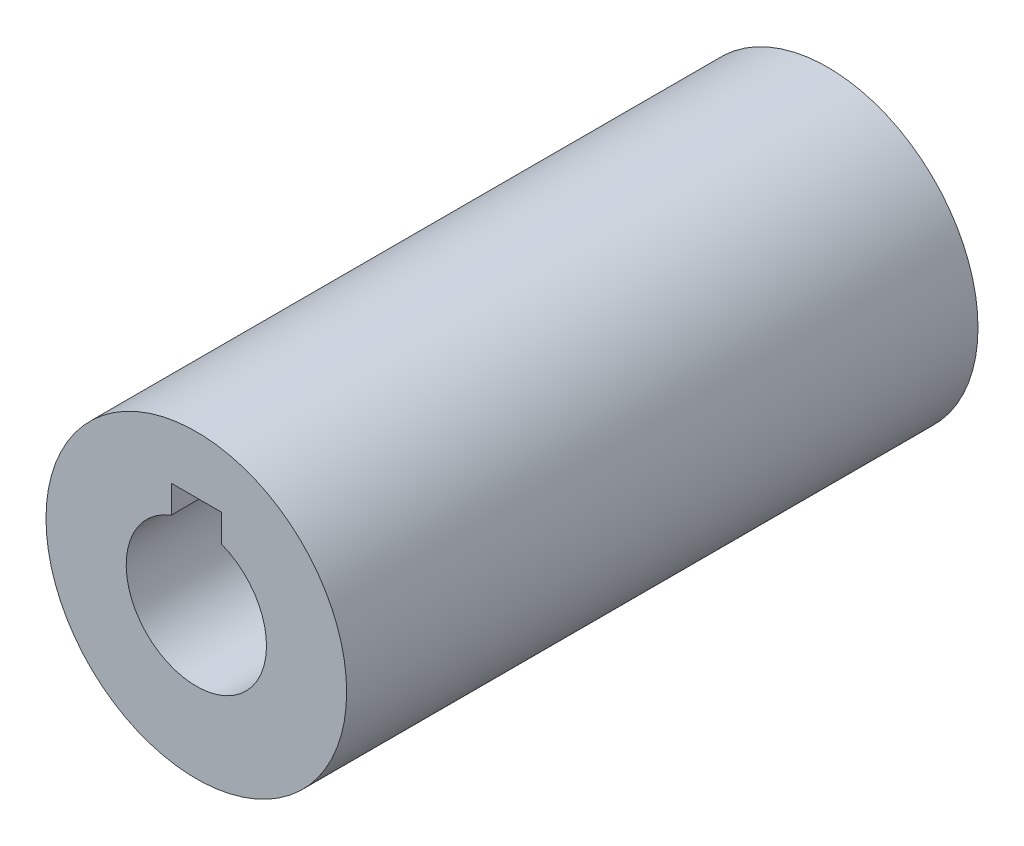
ISO-10303-21;
HEADER;
FILE_DESCRIPTION(('STEP AP214'),'2;1');
FILE_NAME('part.step','',(''),(''),'','','');
FILE_SCHEMA(('AUTOMOTIVE_DESIGN { 1 0 10303 214 1 1 1 1 }'));
ENDSEC;
DATA;
#1=APPLICATION_CONTEXT('core data for automotive mechanical design processes');
#2=APPLICATION_PROTOCOL_DEFINITION('international standard','automotive_design',2000,#1);
#3=PRODUCT_CONTEXT('',#1,'mechanical');
#4=PRODUCT('Part','Part','',(#3));
#5=PRODUCT_RELATED_PRODUCT_CATEGORY('part','',(#4));
#6=PRODUCT_DEFINITION_FORMATION('','',#4);
#7=PRODUCT_DEFINITION_CONTEXT('part definition',#1,'design');
#8=PRODUCT_DEFINITION('design','',#6,#7);
#9=PRODUCT_DEFINITION_SHAPE('','',#8);
#10=(LENGTH_UNIT() NAMED_UNIT(*) SI_UNIT(.MILLI.,.METRE.));
#11=(NAMED_UNIT(*) PLANE_ANGLE_UNIT() SI_UNIT($,.RADIAN.));
#12=(NAMED_UNIT(*) SI_UNIT($,.STERADIAN.) SOLID_ANGLE_UNIT());
#13=UNCERTAINTY_MEASURE_WITH_UNIT(LENGTH_MEASURE(1.E-05),#10,'distance_accuracy_value','');
#14=(GEOMETRIC_REPRESENTATION_CONTEXT(3) GLOBAL_UNCERTAINTY_ASSIGNED_CONTEXT((#13)) GLOBAL_UNIT_ASSIGNED_CONTEXT((#10,
#11,#12)) REPRESENTATION_CONTEXT('',''));
#15=CARTESIAN_POINT('',(0.,0.,0.));
#16=DIRECTION('',(0.,0.,1.));
#17=DIRECTION('',(1.,0.,0.));
#18=AXIS2_PLACEMENT_3D('',#15,#16,#17);
#19=CARTESIAN_POINT('',(2.5,9.3,31.5));
#20=DIRECTION('',(0.,-1.,0.));
#21=DIRECTION('',(0.,0.,-1.));
#22=AXIS2_PLACEMENT_3D('',#19,#20,#21);
#23=PLANE('',#22);
#24=DIRECTION('',(1.,0.,0.));
#25=VECTOR('',#24,1.);
#26=CARTESIAN_POINT('',(0.,9.3,31.5));
#27=LINE('',#26,#25);
#28=CARTESIAN_POINT('',(-2.5,9.3,31.5));
#29=VERTEX_POINT('',#28);
#30=CARTESIAN_POINT('',(2.5,9.3,31.5));
#31=VERTEX_POINT('',#30);
#32=EDGE_CURVE('E84',#29,#31,#27,.T.);
#33=ORIENTED_EDGE('',*,*,#32,.F.);
#34=DIRECTION('',(0.,0.,-1.));
#35=VECTOR('',#34,1.);
#36=CARTESIAN_POINT('',(-2.5,9.3,31.5));
#37=LINE('',#36,#35);
#38=CARTESIAN_POINT('',(-2.5,9.3,-31.5));
#39=VERTEX_POINT('',#38);
#40=EDGE_CURVE('E62',#39,#29,#37,.F.);
#41=ORIENTED_EDGE('',*,*,#40,.F.);
#42=DIRECTION('',(1.,0.,0.));
#43=VECTOR('',#42,1.);
#44=CARTESIAN_POINT('',(0.,9.3,-31.5));
#45=LINE('',#44,#43);
#46=CARTESIAN_POINT('',(2.5,9.3,-31.5));
#47=VERTEX_POINT('',#46);
#48=EDGE_CURVE('E61',#39,#47,#45,.T.);
#49=ORIENTED_EDGE('',*,*,#48,.T.);
#50=DIRECTION('',(0.,0.,1.));
#51=VECTOR('',#50,1.);
#52=CARTESIAN_POINT('',(2.5,9.3,31.5));
#53=LINE('',#52,#51);
#54=EDGE_CURVE('E56',#31,#47,#53,.F.);
#55=ORIENTED_EDGE('',*,*,#54,.F.);
#56=EDGE_LOOP('',(#33,#41,#49,#55));
#57=FACE_BOUND('',#56,.T.);
#58=ADVANCED_FACE('F16',(#57),#23,.T.);
#59=CARTESIAN_POINT('',(2.5,6.53834841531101,31.5));
#60=DIRECTION('',(-1.,0.,0.));
#61=DIRECTION('',(0.,0.,1.));
#62=AXIS2_PLACEMENT_3D('',#59,#60,#61);
#63=PLANE('',#62);
#64=DIRECTION('',(0.,1.,0.));
#65=VECTOR('',#64,1.);
#66=CARTESIAN_POINT('',(2.5,0.,31.5));
#67=LINE('',#66,#65);
#68=CARTESIAN_POINT('',(2.5,6.53834841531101,31.5));
#69=VERTEX_POINT('',#68);
#70=EDGE_CURVE('E71',#31,#69,#67,.F.);
#71=ORIENTED_EDGE('',*,*,#70,.F.);
#72=ORIENTED_EDGE('',*,*,#54,.T.);
#73=DIRECTION('',(0.,1.,0.));
#74=VECTOR('',#73,1.);
#75=CARTESIAN_POINT('',(2.5,0.,-31.5));
#76=LINE('',#75,#74);
#77=CARTESIAN_POINT('',(2.5,6.53834841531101,-31.5));
#78=VERTEX_POINT('',#77);
#79=EDGE_CURVE('E67',#47,#78,#76,.F.);
#80=ORIENTED_EDGE('',*,*,#79,.T.);
#81=DIRECTION('',(0.,0.,1.));
#82=VECTOR('',#81,1.);
#83=CARTESIAN_POINT('',(2.5,6.53834841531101,31.5));
#84=LINE('',#83,#82);
#85=EDGE_CURVE('E46',#78,#69,#84,.T.);
#86=ORIENTED_EDGE('',*,*,#85,.T.);
#87=EDGE_LOOP('',(#71,#72,#80,#86));
#88=FACE_BOUND('',#87,.T.);
#89=ADVANCED_FACE('F69',(#88),#63,.T.);
#90=CARTESIAN_POINT('',(0.,0.,31.5));
#91=DIRECTION('',(0.,0.,1.));
#92=DIRECTION('',(1.,0.,0.));
#93=AXIS2_PLACEMENT_3D('',#90,#91,#92);
#94=CYLINDRICAL_SURFACE('',#93,7.);
#95=DIRECTION('',(0.,0.,-1.));
#96=VECTOR('',#95,1.);
#97=CARTESIAN_POINT('',(-2.5,6.53834841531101,31.5));
#98=LINE('',#97,#96);
#99=CARTESIAN_POINT('',(-2.5,6.53834841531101,31.5));
#100=VERTEX_POINT('',#99);
#101=CARTESIAN_POINT('',(-2.5,6.53834841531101,-31.5));
#102=VERTEX_POINT('',#101);
#103=EDGE_CURVE('E90',#100,#102,#98,.T.);
#104=ORIENTED_EDGE('',*,*,#103,.F.);
#105=CARTESIAN_POINT('',(0.,0.,31.5));
#106=DIRECTION('',(0.,0.,1.));
#107=DIRECTION('',(1.,0.,0.));
#108=AXIS2_PLACEMENT_3D('',#105,#106,#107);
#109=CIRCLE('',#108,7.);
#110=EDGE_CURVE('E19',#69,#100,#109,.F.);
#111=ORIENTED_EDGE('',*,*,#110,.F.);
#112=ORIENTED_EDGE('',*,*,#85,.F.);
#113=CARTESIAN_POINT('',(0.,0.,-31.5));
#114=DIRECTION('',(0.,0.,1.));
#115=DIRECTION('',(1.,0.,0.));
#116=AXIS2_PLACEMENT_3D('',#113,#114,#115);
#117=CIRCLE('',#116,7.);
#118=EDGE_CURVE('E34',#78,#102,#117,.F.);
#119=ORIENTED_EDGE('',*,*,#118,.T.);
#120=EDGE_LOOP('',(#104,#111,#112,#119));
#121=FACE_BOUND('',#120,.T.);
#122=ADVANCED_FACE('F112',(#121),#94,.F.);
#123=CARTESIAN_POINT('',(-2.5,9.3,31.5));
#124=DIRECTION('',(1.,0.,0.));
#125=DIRECTION('',(0.,0.,-1.));
#126=AXIS2_PLACEMENT_3D('',#123,#124,#125);
#127=PLANE('',#126);
#128=DIRECTION('',(0.,1.,0.));
#129=VECTOR('',#128,1.);
#130=CARTESIAN_POINT('',(-2.5,0.,31.5));
#131=LINE('',#130,#129);
#132=EDGE_CURVE('E87',#100,#29,#131,.T.);
#133=ORIENTED_EDGE('',*,*,#132,.F.);
#134=ORIENTED_EDGE('',*,*,#103,.T.);
#135=DIRECTION('',(0.,1.,0.));
#136=VECTOR('',#135,1.);
#137=CARTESIAN_POINT('',(-2.5,0.,-31.5));
#138=LINE('',#137,#136);
#139=EDGE_CURVE('E76',#102,#39,#138,.T.);
#140=ORIENTED_EDGE('',*,*,#139,.T.);
#141=ORIENTED_EDGE('',*,*,#40,.T.);
#142=EDGE_LOOP('',(#133,#134,#140,#141));
#143=FACE_BOUND('',#142,.T.);
#144=ADVANCED_FACE('F110',(#143),#127,.T.);
#145=CARTESIAN_POINT('',(0.,0.,31.5));
#146=DIRECTION('',(0.,0.,1.));
#147=DIRECTION('',(1.,0.,0.));
#148=AXIS2_PLACEMENT_3D('',#145,#146,#147);
#149=PLANE('',#148);
#150=CARTESIAN_POINT('',(0.,0.,31.5));
#151=DIRECTION('',(0.,0.,1.));
#152=DIRECTION('',(1.,0.,0.));
#153=AXIS2_PLACEMENT_3D('',#150,#151,#152);
#154=CIRCLE('',#153,15.);
#155=CARTESIAN_POINT('',(15.,0.,31.5));
#156=VERTEX_POINT('',#155);
#157=EDGE_CURVE('E25',#156,#156,#154,.F.);
#158=ORIENTED_EDGE('',*,*,#157,.F.);
#159=EDGE_LOOP('',(#158));
#160=FACE_BOUND('',#159,.T.);
#161=ORIENTED_EDGE('',*,*,#70,.T.);
#162=ORIENTED_EDGE('',*,*,#110,.T.);
#163=ORIENTED_EDGE('',*,*,#132,.T.);
#164=ORIENTED_EDGE('',*,*,#32,.T.);
#165=EDGE_LOOP('',(#161,#162,#163,#164));
#166=FACE_BOUND('',#165,.T.);
#167=ADVANCED_FACE('F114',(#160,#166),#149,.T.);
#168=CARTESIAN_POINT('',(0.,0.,-31.5));
#169=DIRECTION('',(0.,0.,1.));
#170=DIRECTION('',(1.,0.,0.));
#171=AXIS2_PLACEMENT_3D('',#168,#169,#170);
#172=PLANE('',#171);
#173=CARTESIAN_POINT('',(0.,0.,-31.5));
#174=DIRECTION('',(0.,0.,1.));
#175=DIRECTION('',(1.,0.,0.));
#176=AXIS2_PLACEMENT_3D('',#173,#174,#175);
#177=CIRCLE('',#176,15.);
#178=CARTESIAN_POINT('',(15.,0.,-31.5));
#179=VERTEX_POINT('',#178);
#180=EDGE_CURVE('E11',#179,#179,#177,.T.);
#181=ORIENTED_EDGE('',*,*,#180,.F.);
#182=EDGE_LOOP('',(#181));
#183=FACE_BOUND('',#182,.T.);
#184=ORIENTED_EDGE('',*,*,#118,.F.);
#185=ORIENTED_EDGE('',*,*,#79,.F.);
#186=ORIENTED_EDGE('',*,*,#48,.F.);
#187=ORIENTED_EDGE('',*,*,#139,.F.);
#188=EDGE_LOOP('',(#184,#185,#186,#187));
#189=FACE_BOUND('',#188,.T.);
#190=ADVANCED_FACE('F74',(#183,#189),#172,.F.);
#191=CARTESIAN_POINT('',(0.,0.,31.5));
#192=DIRECTION('',(0.,0.,1.));
#193=DIRECTION('',(1.,0.,0.));
#194=AXIS2_PLACEMENT_3D('',#191,#192,#193);
#195=CYLINDRICAL_SURFACE('',#194,15.);
#196=ORIENTED_EDGE('',*,*,#180,.T.);
#197=EDGE_LOOP('',(#196));
#198=FACE_BOUND('',#197,.T.);
#199=ORIENTED_EDGE('',*,*,#157,.T.);
#200=EDGE_LOOP('',(#199));
#201=FACE_BOUND('',#200,.T.);
#202=ADVANCED_FACE('F123',(#198,#201),#195,.T.);
#203=CLOSED_SHELL('',(#58,#89,#122,#144,#167,#190,#202));
#204=MANIFOLD_SOLID_BREP('B1',#203);
#205=ADVANCED_BREP_SHAPE_REPRESENTATION('',(#18,#204),#14);
#206=SHAPE_DEFINITION_REPRESENTATION(#9,#205);
ENDSEC;
END-ISO-10303-21;
